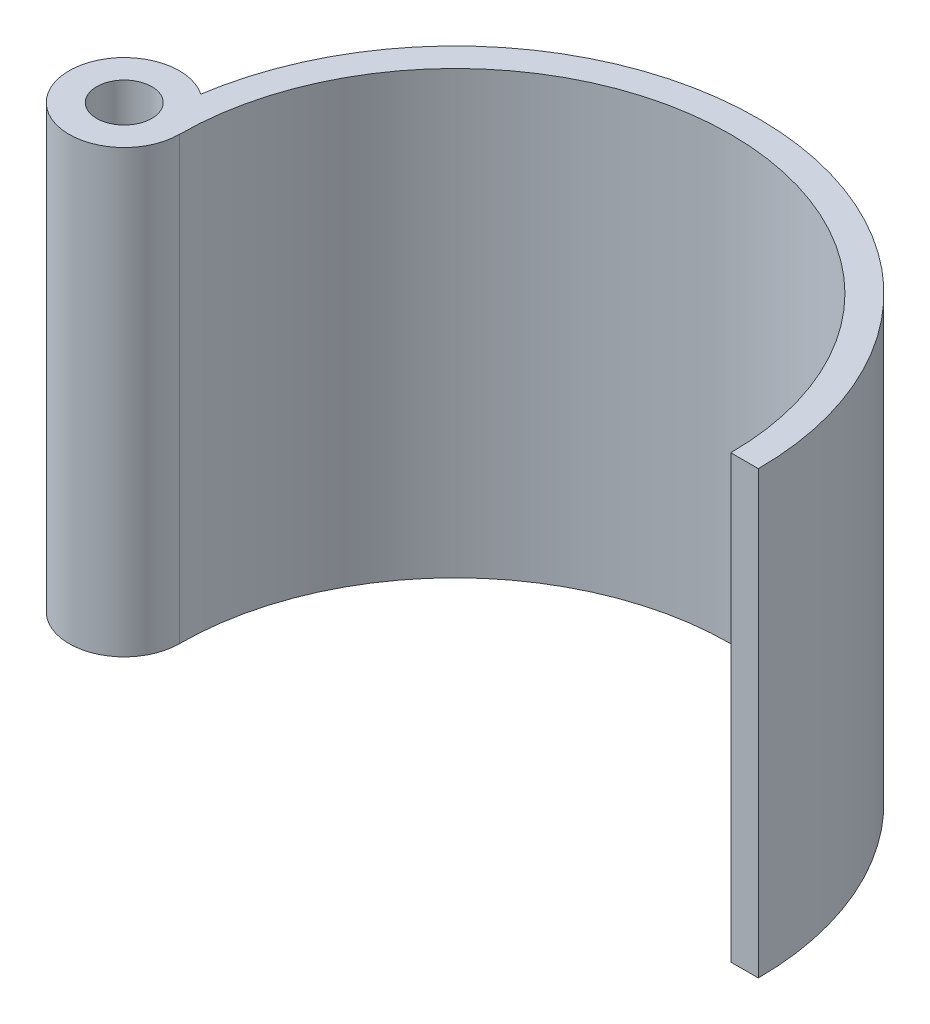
ISO-10303-21;
HEADER;
FILE_DESCRIPTION(('STEP AP214'),'2;1');
FILE_NAME('part.step','',(''),(''),'','','');
FILE_SCHEMA(('AUTOMOTIVE_DESIGN { 1 0 10303 214 1 1 1 1 }'));
ENDSEC;
DATA;
#1=APPLICATION_CONTEXT('core data for automotive mechanical design processes');
#2=APPLICATION_PROTOCOL_DEFINITION('international standard','automotive_design',2000,#1);
#3=PRODUCT_CONTEXT('',#1,'mechanical');
#4=PRODUCT('Part','Part','',(#3));
#5=PRODUCT_RELATED_PRODUCT_CATEGORY('part','',(#4));
#6=PRODUCT_DEFINITION_FORMATION('','',#4);
#7=PRODUCT_DEFINITION_CONTEXT('part definition',#1,'design');
#8=PRODUCT_DEFINITION('design','',#6,#7);
#9=PRODUCT_DEFINITION_SHAPE('','',#8);
#10=(LENGTH_UNIT() NAMED_UNIT(*) SI_UNIT(.MILLI.,.METRE.));
#11=(NAMED_UNIT(*) PLANE_ANGLE_UNIT() SI_UNIT($,.RADIAN.));
#12=(NAMED_UNIT(*) SI_UNIT($,.STERADIAN.) SOLID_ANGLE_UNIT());
#13=UNCERTAINTY_MEASURE_WITH_UNIT(LENGTH_MEASURE(1.E-05),#10,'distance_accuracy_value','');
#14=(GEOMETRIC_REPRESENTATION_CONTEXT(3) GLOBAL_UNCERTAINTY_ASSIGNED_CONTEXT((#13)) GLOBAL_UNIT_ASSIGNED_CONTEXT((#10,
#11,#12)) REPRESENTATION_CONTEXT('',''));
#15=CARTESIAN_POINT('',(0.,0.,0.));
#16=DIRECTION('',(0.,0.,1.));
#17=DIRECTION('',(1.,0.,0.));
#18=AXIS2_PLACEMENT_3D('',#15,#16,#17);
#19=CARTESIAN_POINT('',(60.,80.,0.));
#20=DIRECTION('',(0.,-1.,0.));
#21=DIRECTION('',(0.,0.,-1.));
#22=AXIS2_PLACEMENT_3D('',#19,#20,#21);
#23=PLANE('',#22);
#24=CARTESIAN_POINT('',(60.,80.,0.));
#25=DIRECTION('',(0.,-1.,0.));
#26=DIRECTION('',(0.,0.,-1.));
#27=AXIS2_PLACEMENT_3D('',#24,#25,#26);
#28=CIRCLE('',#27,50.);
#29=CARTESIAN_POINT('',(10.,80.,0.));
#30=VERTEX_POINT('',#29);
#31=CARTESIAN_POINT('',(110.,80.,0.));
#32=VERTEX_POINT('',#31);
#33=EDGE_CURVE('E84',#30,#32,#28,.T.);
#34=ORIENTED_EDGE('',*,*,#33,.T.);
#35=DIRECTION('',(1.,0.,0.));
#36=VECTOR('',#35,1.);
#37=CARTESIAN_POINT('',(115.,80.,0.));
#38=LINE('',#37,#36);
#39=CARTESIAN_POINT('',(115.,80.,0.));
#40=VERTEX_POINT('',#39);
#41=EDGE_CURVE('E79',#32,#40,#38,.T.);
#42=ORIENTED_EDGE('',*,*,#41,.T.);
#43=CARTESIAN_POINT('',(60.,80.,0.));
#44=DIRECTION('',(0.,1.,0.));
#45=DIRECTION('',(0.,0.,-1.));
#46=AXIS2_PLACEMENT_3D('',#43,#44,#45);
#47=CIRCLE('',#46,55.);
#48=CARTESIAN_POINT('',(5.62500000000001,80.,-8.26797284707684));
#49=VERTEX_POINT('',#48);
#50=EDGE_CURVE('E82',#40,#49,#47,.T.);
#51=ORIENTED_EDGE('',*,*,#50,.T.);
#52=CARTESIAN_POINT('',(0.,80.,0.));
#53=DIRECTION('',(0.,1.,0.));
#54=DIRECTION('',(0.,0.,1.));
#55=AXIS2_PLACEMENT_3D('',#52,#53,#54);
#56=CIRCLE('',#55,10.);
#57=EDGE_CURVE('E49',#49,#30,#56,.T.);
#58=ORIENTED_EDGE('',*,*,#57,.T.);
#59=EDGE_LOOP('',(#34,#42,#51,#58));
#60=FACE_BOUND('',#59,.T.);
#61=CARTESIAN_POINT('',(0.,80.,0.));
#62=DIRECTION('',(0.,1.,0.));
#63=DIRECTION('',(0.,0.,1.));
#64=AXIS2_PLACEMENT_3D('',#61,#62,#63);
#65=CIRCLE('',#64,5.);
#66=CARTESIAN_POINT('',(0.,80.,5.));
#67=VERTEX_POINT('',#66);
#68=EDGE_CURVE('E99',#67,#67,#65,.T.);
#69=ORIENTED_EDGE('',*,*,#68,.F.);
#70=EDGE_LOOP('',(#69));
#71=FACE_BOUND('',#70,.T.);
#72=ADVANCED_FACE('F32',(#60,#71),#23,.F.);
#73=CARTESIAN_POINT('',(60.,0.,0.));
#74=DIRECTION('',(0.,-1.,0.));
#75=DIRECTION('',(0.,0.,-1.));
#76=AXIS2_PLACEMENT_3D('',#73,#74,#75);
#77=PLANE('',#76);
#78=CARTESIAN_POINT('',(60.,0.,0.));
#79=DIRECTION('',(0.,-1.,0.));
#80=DIRECTION('',(0.,0.,-1.));
#81=AXIS2_PLACEMENT_3D('',#78,#79,#80);
#82=CIRCLE('',#81,50.);
#83=CARTESIAN_POINT('',(10.,0.,0.));
#84=VERTEX_POINT('',#83);
#85=CARTESIAN_POINT('',(110.,0.,0.));
#86=VERTEX_POINT('',#85);
#87=EDGE_CURVE('E96',#84,#86,#82,.T.);
#88=ORIENTED_EDGE('',*,*,#87,.F.);
#89=CARTESIAN_POINT('',(0.,0.,0.));
#90=DIRECTION('',(0.,1.,0.));
#91=DIRECTION('',(0.,0.,1.));
#92=AXIS2_PLACEMENT_3D('',#89,#90,#91);
#93=CIRCLE('',#92,10.);
#94=CARTESIAN_POINT('',(5.62500000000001,0.,-8.26797284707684));
#95=VERTEX_POINT('',#94);
#96=EDGE_CURVE('E72',#95,#84,#93,.T.);
#97=ORIENTED_EDGE('',*,*,#96,.F.);
#98=CARTESIAN_POINT('',(60.,0.,0.));
#99=DIRECTION('',(0.,1.,0.));
#100=DIRECTION('',(0.,0.,-1.));
#101=AXIS2_PLACEMENT_3D('',#98,#99,#100);
#102=CIRCLE('',#101,55.);
#103=CARTESIAN_POINT('',(115.,0.,0.));
#104=VERTEX_POINT('',#103);
#105=EDGE_CURVE('E66',#104,#95,#102,.T.);
#106=ORIENTED_EDGE('',*,*,#105,.F.);
#107=DIRECTION('',(1.,0.,0.));
#108=VECTOR('',#107,1.);
#109=CARTESIAN_POINT('',(115.,0.,0.));
#110=LINE('',#109,#108);
#111=EDGE_CURVE('E88',#86,#104,#110,.T.);
#112=ORIENTED_EDGE('',*,*,#111,.F.);
#113=EDGE_LOOP('',(#88,#97,#106,#112));
#114=FACE_BOUND('',#113,.T.);
#115=CARTESIAN_POINT('',(0.,0.,0.));
#116=DIRECTION('',(0.,1.,0.));
#117=DIRECTION('',(0.,0.,1.));
#118=AXIS2_PLACEMENT_3D('',#115,#116,#117);
#119=CIRCLE('',#118,5.);
#120=CARTESIAN_POINT('',(0.,0.,5.));
#121=VERTEX_POINT('',#120);
#122=EDGE_CURVE('E111',#121,#121,#119,.T.);
#123=ORIENTED_EDGE('',*,*,#122,.T.);
#124=EDGE_LOOP('',(#123));
#125=FACE_BOUND('',#124,.T.);
#126=ADVANCED_FACE('F107',(#114,#125),#77,.T.);
#127=CARTESIAN_POINT('',(60.,80.,0.));
#128=DIRECTION('',(0.,-1.,0.));
#129=DIRECTION('',(0.,0.,-1.));
#130=AXIS2_PLACEMENT_3D('',#127,#128,#129);
#131=CYLINDRICAL_SURFACE('',#130,50.);
#132=ORIENTED_EDGE('',*,*,#87,.T.);
#133=DIRECTION('',(0.,-1.,0.));
#134=VECTOR('',#133,1.);
#135=CARTESIAN_POINT('',(110.,80.,0.));
#136=LINE('',#135,#134);
#137=EDGE_CURVE('E11',#32,#86,#136,.T.);
#138=ORIENTED_EDGE('',*,*,#137,.F.);
#139=ORIENTED_EDGE('',*,*,#33,.F.);
#140=DIRECTION('',(0.,-1.,0.));
#141=VECTOR('',#140,1.);
#142=CARTESIAN_POINT('',(10.,80.,0.));
#143=LINE('',#142,#141);
#144=EDGE_CURVE('E92',#30,#84,#143,.T.);
#145=ORIENTED_EDGE('',*,*,#144,.T.);
#146=EDGE_LOOP('',(#132,#138,#139,#145));
#147=FACE_BOUND('',#146,.T.);
#148=ADVANCED_FACE('F34',(#147),#131,.F.);
#149=CARTESIAN_POINT('',(115.,80.,0.));
#150=DIRECTION('',(0.,0.,-1.));
#151=DIRECTION('',(-1.,0.,0.));
#152=AXIS2_PLACEMENT_3D('',#149,#150,#151);
#153=PLANE('',#152);
#154=ORIENTED_EDGE('',*,*,#111,.T.);
#155=DIRECTION('',(0.,-1.,0.));
#156=VECTOR('',#155,1.);
#157=CARTESIAN_POINT('',(115.,80.,0.));
#158=LINE('',#157,#156);
#159=EDGE_CURVE('E41',#40,#104,#158,.T.);
#160=ORIENTED_EDGE('',*,*,#159,.F.);
#161=ORIENTED_EDGE('',*,*,#41,.F.);
#162=ORIENTED_EDGE('',*,*,#137,.T.);
#163=EDGE_LOOP('',(#154,#160,#161,#162));
#164=FACE_BOUND('',#163,.T.);
#165=ADVANCED_FACE('F87',(#164),#153,.F.);
#166=CARTESIAN_POINT('',(60.,80.,0.));
#167=DIRECTION('',(0.,-1.,0.));
#168=DIRECTION('',(0.,0.,-1.));
#169=AXIS2_PLACEMENT_3D('',#166,#167,#168);
#170=CYLINDRICAL_SURFACE('',#169,55.);
#171=ORIENTED_EDGE('',*,*,#105,.T.);
#172=DIRECTION('',(0.,-1.,0.));
#173=VECTOR('',#172,1.);
#174=CARTESIAN_POINT('',(5.62500000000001,80.,-8.26797284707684));
#175=LINE('',#174,#173);
#176=EDGE_CURVE('E89',#49,#95,#175,.T.);
#177=ORIENTED_EDGE('',*,*,#176,.F.);
#178=ORIENTED_EDGE('',*,*,#50,.F.);
#179=ORIENTED_EDGE('',*,*,#159,.T.);
#180=EDGE_LOOP('',(#171,#177,#178,#179));
#181=FACE_BOUND('',#180,.T.);
#182=ADVANCED_FACE('F90',(#181),#170,.T.);
#183=CARTESIAN_POINT('',(0.,80.,0.));
#184=DIRECTION('',(0.,-1.,0.));
#185=DIRECTION('',(0.,0.,-1.));
#186=AXIS2_PLACEMENT_3D('',#183,#184,#185);
#187=CYLINDRICAL_SURFACE('',#186,10.);
#188=ORIENTED_EDGE('',*,*,#96,.T.);
#189=ORIENTED_EDGE('',*,*,#144,.F.);
#190=ORIENTED_EDGE('',*,*,#57,.F.);
#191=ORIENTED_EDGE('',*,*,#176,.T.);
#192=EDGE_LOOP('',(#188,#189,#190,#191));
#193=FACE_BOUND('',#192,.T.);
#194=ADVANCED_FACE('F104',(#193),#187,.T.);
#195=CARTESIAN_POINT('',(0.,80.,0.));
#196=DIRECTION('',(0.,-1.,0.));
#197=DIRECTION('',(0.,0.,-1.));
#198=AXIS2_PLACEMENT_3D('',#195,#196,#197);
#199=CYLINDRICAL_SURFACE('',#198,5.);
#200=ORIENTED_EDGE('',*,*,#68,.T.);
#201=EDGE_LOOP('',(#200));
#202=FACE_BOUND('',#201,.T.);
#203=ORIENTED_EDGE('',*,*,#122,.F.);
#204=EDGE_LOOP('',(#203));
#205=FACE_BOUND('',#204,.T.);
#206=ADVANCED_FACE('F117',(#202,#205),#199,.F.);
#207=CLOSED_SHELL('',(#72,#126,#148,#165,#182,#194,#206));
#208=MANIFOLD_SOLID_BREP('B2',#207);
#209=ADVANCED_BREP_SHAPE_REPRESENTATION('',(#18,#208),#14);
#210=SHAPE_DEFINITION_REPRESENTATION(#9,#209);
ENDSEC;
END-ISO-10303-21;
